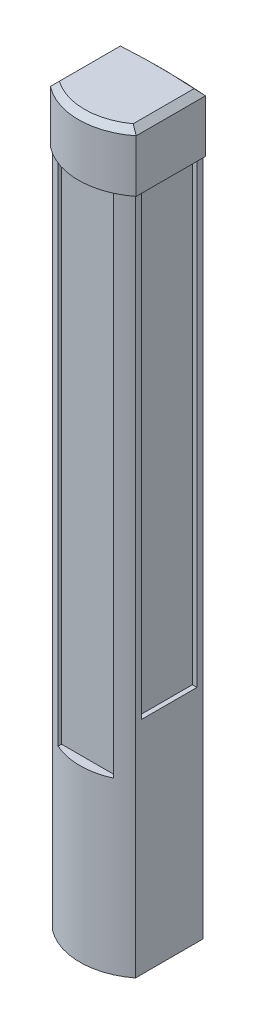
from build123d import *

# Parameters (mm, degrees)
Y_KSEKLIK_EKSTR_ZYON1_DEPTH = 1600
KES_EKSTR_ZYON1_START       = 70
IZIM2_W                     = 120.222043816
IZIM2_H                     = 1105
KES_EKSTR_ZYON1_DEPTH       = 30
IZIM3_W                     = 120.762209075
IZIM3_H                     = 995
KES_EKSTR_ZYON2_DEPTH       = 10
KES_EKSTR_ZYON3_START       = -80
IZIM5_W                     = 120.222043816
IZIM5_H                     = 1000
KES_EKSTR_ZYON3_DEPTH       = 20
Y_KSEKLIK_EKSTR_ZYON3_START = -127
Y_KSEKLIK_EKSTR_ZYON3_DEPTH = 127
PAH1_SIZE                   = 13


with BuildPart() as part:
    # izim1 → Y_kseklik-Ekstr_zyon1 (new body)
    with BuildSketch(Plane(origin=(0, 0, 0), x_dir=(1, 0, 0), z_dir=(0, 1, 0))):
        with BuildLine():
            Line((90.111021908, 76.625355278), (90.111021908, -59.670974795))
            ThreePointArc((90.111021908, -59.670974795), (0, -90.404100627), (-90.111021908, -59.670974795))
            Line((-90.111021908, -59.670974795), (-90.111021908, 75.941610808))
            Line((-90.111021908, 75.941610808), (-90.111021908, 87.09123428))
            ThreePointArc((-90.111021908, 87.09123428), (0.004425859, 90.403112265), (90.111021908, 86.858565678))
            Line((90.111021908, 86.858565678), (90.111021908, 76.625355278))
        make_face()
    extrude(amount=Y_KSEKLIK_EKSTR_ZYON1_DEPTH)

    # izim2 → Kes-Ekstr_zyon1 (cut)
    with BuildSketch(Plane.XY.offset(KES_EKSTR_ZYON1_START)):
        with Locations((0, 922.5)):
            Rectangle(IZIM2_W, IZIM2_H)
    extrude(amount=KES_EKSTR_ZYON1_DEPTH, mode=Mode.SUBTRACT)

    # izim3 → Kes-Ekstr_zyon2 (cut)
    with BuildSketch(Plane.ZY.offset(90.111021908)):
        with Locations((-13.710129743, 977.5)):
            Rectangle(IZIM3_W, IZIM3_H)
    kes_ekstr_zyon2 = extrude(amount=-KES_EKSTR_ZYON2_DEPTH, mode=Mode.SUBTRACT)

    # Aynalama1: Kes-Ekstr_zyon2 across plane
    add(kes_ekstr_zyon2.mirror(Plane(origin=(0, 0, 0), x_dir=(0, 0, 1), z_dir=(1, 0, 0))), mode=Mode.SUBTRACT)

    # izim5 → Kes-Ekstr_zyon3 (cut)
    with BuildSketch(Plane.XY.offset(KES_EKSTR_ZYON3_START)):
        with Locations((0, 975)):
            Rectangle(IZIM5_W, IZIM5_H)
    extrude(amount=-KES_EKSTR_ZYON3_DEPTH, mode=Mode.SUBTRACT)

    # izim6 → Y_kseklik-Ekstr_zyon3 (add)
    with BuildSketch(Plane(origin=(0, 1600, 0), x_dir=(1, 0, 0), z_dir=(0, 1, 0)).offset(Y_KSEKLIK_EKSTR_ZYON3_START)):
        with BuildLine():
            Line((-93.111021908, 89.871667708), (-93.111021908, -61.135861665))
            ThreePointArc((-93.111021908, -61.135861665), (0, -93.404100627), (93.111021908, -61.135861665))
            Line((93.111021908, -61.135861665), (93.111021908, 89.631816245))
            ThreePointArc((93.111021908, 89.631816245), (0.004702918, 93.403114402), (-93.111021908, 89.871667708))
        make_face()
        with BuildLine():
            Line((90.111021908, -59.670974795), (90.111021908, 86.858565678))
            ThreePointArc((90.111021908, 86.858565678), (0.004425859, 90.403112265), (-90.111021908, 87.09123428))
            Line((-90.111021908, 87.09123428), (-90.111021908, -59.670974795))
            ThreePointArc((-90.111021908, -59.670974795), (0, -90.404100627), (90.111021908, -59.670974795))
        make_face(mode=Mode.SUBTRACT)
    extrude(amount=Y_KSEKLIK_EKSTR_ZYON3_DEPTH)

    # Pah1
    pah1_edges = [part.edges().sort_by_distance(p)[0] for p in [
        (0.004702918, 1600, -93.403114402),
        (-93.111021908, 1600, -14.367903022),
        (0, 1600, 93.404100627),
        (93.111021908, 1600, -14.24797729),
    ]]
    chamfer(pah1_edges, length=PAH1_SIZE)


solid = part.part
